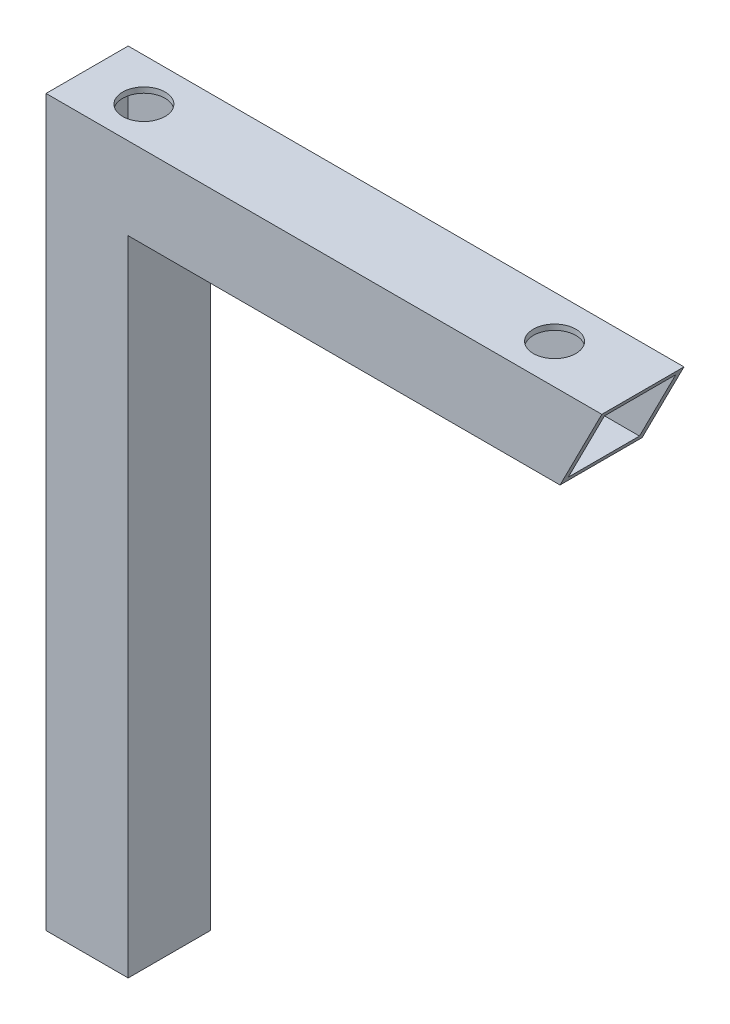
from build123d import *

# Parameters (mm, degrees)
BOSS_EXTRU_1_DEPTH      = 30
COQUE1_T                = -2
ESQUISSE2_W             = 26
ESQUISSE2_H             = 26
ENL_V_MAT_EXTRU_1_DEPTH = 30
D_GAGEMENT_M141_D       = 15.5


with BuildPart() as part:
    # Esquisse1 → Boss.-Extru.1 (new body)
    with BuildSketch(Plane.XY):
        Polygon((14.779261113, -143.515804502), (-15.220738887, -143.515804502), (-15.220738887, 121.284195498), (187.779261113, 121.284195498), (172.513278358, 91.284195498), (14.779261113, 91.284195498), align=None)
    extrude(amount=BOSS_EXTRU_1_DEPTH)

    # Coque1
    coque1_openings = [part.faces().sort_by_distance(p)[0] for p in [
        (180.146269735, 106.284195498, 15),
    ]]
    offset(amount=COQUE1_T, openings=coque1_openings, kind=Kind.INTERSECTION)

    # Esquisse2 → Enl_v. mat.-Extru.1 (cut)
    with BuildSketch(Plane.XZ.offset(143.515804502)):
        with Locations((-0.220738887, 15)):
            Rectangle(ESQUISSE2_W, ESQUISSE2_H)
    extrude(amount=-ENL_V_MAT_EXTRU_1_DEPTH, mode=Mode.SUBTRACT)

    # D_gagement M141 (through all)
    with Locations(Plane(origin=(0, 121.284195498, 0), x_dir=(1, 0, 0), z_dir=(0, 1, 0))):
        with Locations((156.069261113, -15.543280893), (6.069261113, -15.543280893)):
            Hole(D_GAGEMENT_M141_D / 2)


solid = part.part
